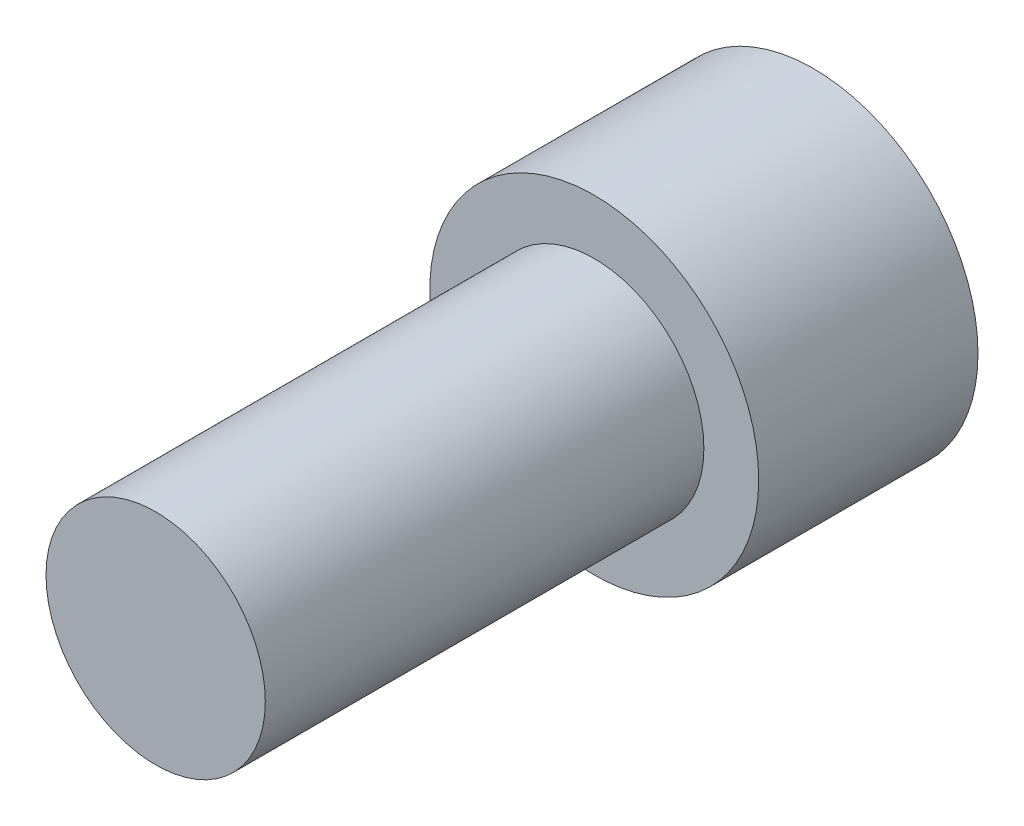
from build123d import *

# Parameters (mm, degrees)
HEX_2_DEPTH = 7.112


with BuildPart() as part:
    # Sketch6 → Revolve1 (revolve)
    with BuildSketch(Plane(origin=(0, 0, 0), x_dir=(0, 0, -1), z_dir=(1, 0, 0)), mode=Mode.PRIVATE) as revolve1_sk:
        Polygon((-25.4, 0), (-25.4, -6.35), (0, -6.35), (0, -9.525), (12.7, -9.525), (12.7, 0), align=None)
    revolve(revolve1_sk.sketch.rotate(Axis((0, 0, 25.4), (0, 0, -1)), 270), axis=Axis((0, 0, 25.4), (0, 0, -1)))

    # Sketch7 → HEX 2 (cut)
    with BuildSketch(Plane(origin=(0, 0, -12.7), x_dir=(-1, 0, 0), z_dir=(0, 0, -1))):
        Polygon((-4.7625, 2.749630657), (-4.7625, -2.749630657), (0, -5.499261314), (4.7625, -2.749630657), (4.7625, 2.749630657), (0, 5.499261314), align=None)
    extrude(amount=-HEX_2_DEPTH, mode=Mode.SUBTRACT)


solid = part.part
